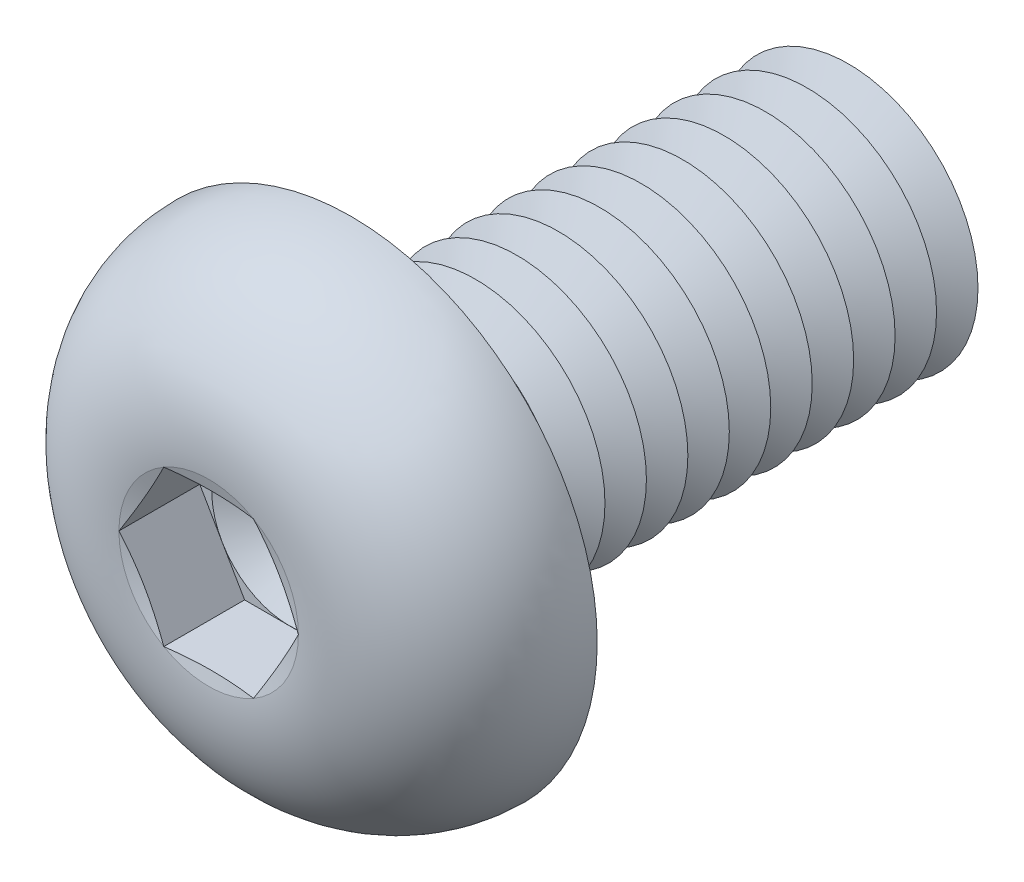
ISO-10303-21;
HEADER;
FILE_DESCRIPTION(('STEP AP214'),'2;1');
FILE_NAME('part.step','',(''),(''),'','','');
FILE_SCHEMA(('AUTOMOTIVE_DESIGN { 1 0 10303 214 1 1 1 1 }'));
ENDSEC;
DATA;
#1=APPLICATION_CONTEXT('core data for automotive mechanical design processes');
#2=APPLICATION_PROTOCOL_DEFINITION('international standard','automotive_design',2000,#1);
#3=PRODUCT_CONTEXT('',#1,'mechanical');
#4=PRODUCT('Part','Part','',(#3));
#5=PRODUCT_RELATED_PRODUCT_CATEGORY('part','',(#4));
#6=PRODUCT_DEFINITION_FORMATION('','',#4);
#7=PRODUCT_DEFINITION_CONTEXT('part definition',#1,'design');
#8=PRODUCT_DEFINITION('design','',#6,#7);
#9=PRODUCT_DEFINITION_SHAPE('','',#8);
#10=(LENGTH_UNIT() NAMED_UNIT(*) SI_UNIT(.MILLI.,.METRE.));
#11=(NAMED_UNIT(*) PLANE_ANGLE_UNIT() SI_UNIT($,.RADIAN.));
#12=(NAMED_UNIT(*) SI_UNIT($,.STERADIAN.) SOLID_ANGLE_UNIT());
#13=UNCERTAINTY_MEASURE_WITH_UNIT(LENGTH_MEASURE(1.E-05),#10,'distance_accuracy_value','');
#14=(GEOMETRIC_REPRESENTATION_CONTEXT(3) GLOBAL_UNCERTAINTY_ASSIGNED_CONTEXT((#13)) GLOBAL_UNIT_ASSIGNED_CONTEXT((#10,
#11,#12)) REPRESENTATION_CONTEXT('',''));
#15=CARTESIAN_POINT('',(0.,0.,0.));
#16=DIRECTION('',(0.,0.,1.));
#17=DIRECTION('',(1.,0.,0.));
#18=AXIS2_PLACEMENT_3D('',#15,#16,#17);
#19=CARTESIAN_POINT('',(0.,0.,1.19));
#20=DIRECTION('',(0.,0.,1.));
#21=DIRECTION('',(1.,0.,0.));
#22=AXIS2_PLACEMENT_3D('',#19,#20,#21);
#23=PLANE('',#22);
#24=CARTESIAN_POINT('',(0.,0.,1.19));
#25=DIRECTION('',(0.,0.,1.));
#26=DIRECTION('',(1.,0.,0.));
#27=AXIS2_PLACEMENT_3D('',#24,#25,#26);
#28=CIRCLE('',#27,1.49999930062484);
#29=CARTESIAN_POINT('',(1.2990375,0.749999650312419,1.19));
#30=VERTEX_POINT('',#29);
#31=CARTESIAN_POINT('',(0.,1.49999930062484,1.19));
#32=VERTEX_POINT('',#31);
#33=EDGE_CURVE('E118',#30,#32,#28,.T.);
#34=ORIENTED_EDGE('',*,*,#33,.F.);
#35=DIRECTION('',(-0.5,0.866025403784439,0.));
#36=VECTOR('',#35,1.);
#37=CARTESIAN_POINT('',(1.73205,0.,1.19));
#38=LINE('',#37,#36);
#39=CARTESIAN_POINT('',(0.866025,1.49999930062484,1.19));
#40=VERTEX_POINT('',#39);
#41=EDGE_CURVE('E125',#30,#40,#38,.T.);
#42=ORIENTED_EDGE('',*,*,#41,.T.);
#43=DIRECTION('',(-1.,0.,0.));
#44=VECTOR('',#43,1.);
#45=CARTESIAN_POINT('',(0.866025,1.49999930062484,1.19));
#46=LINE('',#45,#44);
#47=EDGE_CURVE('E136',#40,#32,#46,.T.);
#48=ORIENTED_EDGE('',*,*,#47,.T.);
#49=EDGE_LOOP('',(#34,#42,#48));
#50=FACE_BOUND('',#49,.T.);
#51=ADVANCED_FACE('F39',(#50),#23,.T.);
#52=CARTESIAN_POINT('',(0.,0.,1.19));
#53=DIRECTION('',(0.,0.,1.));
#54=DIRECTION('',(1.,0.,0.));
#55=AXIS2_PLACEMENT_3D('',#52,#53,#54);
#56=CIRCLE('',#55,1.49999930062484);
#57=CARTESIAN_POINT('',(-1.2990375,0.749999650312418,1.19));
#58=VERTEX_POINT('',#57);
#59=EDGE_CURVE('E11',#32,#58,#56,.T.);
#60=ORIENTED_EDGE('',*,*,#59,.F.);
#61=CARTESIAN_POINT('',(-0.866025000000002,1.49999930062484,1.19));
#62=VERTEX_POINT('',#61);
#63=EDGE_CURVE('E131',#32,#62,#46,.T.);
#64=ORIENTED_EDGE('',*,*,#63,.T.);
#65=DIRECTION('',(-0.5,-0.866025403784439,0.));
#66=VECTOR('',#65,1.);
#67=CARTESIAN_POINT('',(-0.866025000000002,1.49999930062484,1.19));
#68=LINE('',#67,#66);
#69=EDGE_CURVE('E134',#62,#58,#68,.T.);
#70=ORIENTED_EDGE('',*,*,#69,.T.);
#71=EDGE_LOOP('',(#60,#64,#70));
#72=FACE_BOUND('',#71,.T.);
#73=ADVANCED_FACE('F130',(#72),#23,.T.);
#74=CARTESIAN_POINT('',(-1.2990375,-0.749999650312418,1.19));
#75=VERTEX_POINT('',#74);
#76=EDGE_CURVE('E49',#58,#75,#56,.T.);
#77=ORIENTED_EDGE('',*,*,#76,.F.);
#78=CARTESIAN_POINT('',(-1.73205,0.,1.19));
#79=VERTEX_POINT('',#78);
#80=EDGE_CURVE('E143',#58,#79,#68,.T.);
#81=ORIENTED_EDGE('',*,*,#80,.T.);
#82=DIRECTION('',(0.5,-0.866025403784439,0.));
#83=VECTOR('',#82,1.);
#84=CARTESIAN_POINT('',(-1.73205,0.,1.19));
#85=LINE('',#84,#83);
#86=EDGE_CURVE('E151',#79,#75,#85,.T.);
#87=ORIENTED_EDGE('',*,*,#86,.T.);
#88=EDGE_LOOP('',(#77,#81,#87));
#89=FACE_BOUND('',#88,.T.);
#90=ADVANCED_FACE('F368',(#89),#23,.T.);
#91=CARTESIAN_POINT('',(0.,-1.49999930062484,1.19));
#92=VERTEX_POINT('',#91);
#93=EDGE_CURVE('E352',#75,#92,#56,.T.);
#94=ORIENTED_EDGE('',*,*,#93,.F.);
#95=CARTESIAN_POINT('',(-0.866025,-1.49999930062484,1.19));
#96=VERTEX_POINT('',#95);
#97=EDGE_CURVE('E150',#75,#96,#85,.T.);
#98=ORIENTED_EDGE('',*,*,#97,.T.);
#99=DIRECTION('',(1.,0.,0.));
#100=VECTOR('',#99,1.);
#101=CARTESIAN_POINT('',(-0.866025,-1.49999930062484,1.19));
#102=LINE('',#101,#100);
#103=EDGE_CURVE('E156',#96,#92,#102,.T.);
#104=ORIENTED_EDGE('',*,*,#103,.T.);
#105=EDGE_LOOP('',(#94,#98,#104));
#106=FACE_BOUND('',#105,.T.);
#107=ADVANCED_FACE('F361',(#106),#23,.T.);
#108=CARTESIAN_POINT('',(1.2990375,-0.749999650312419,1.19));
#109=VERTEX_POINT('',#108);
#110=EDGE_CURVE('E56',#92,#109,#56,.T.);
#111=ORIENTED_EDGE('',*,*,#110,.F.);
#112=CARTESIAN_POINT('',(0.866025,-1.49999930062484,1.19));
#113=VERTEX_POINT('',#112);
#114=EDGE_CURVE('E155',#92,#113,#102,.T.);
#115=ORIENTED_EDGE('',*,*,#114,.T.);
#116=DIRECTION('',(0.5,0.866025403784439,0.));
#117=VECTOR('',#116,1.);
#118=CARTESIAN_POINT('',(0.866025,-1.49999930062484,1.19));
#119=LINE('',#118,#117);
#120=EDGE_CURVE('E161',#113,#109,#119,.T.);
#121=ORIENTED_EDGE('',*,*,#120,.T.);
#122=EDGE_LOOP('',(#111,#115,#121));
#123=FACE_BOUND('',#122,.T.);
#124=ADVANCED_FACE('F428',(#123),#23,.T.);
#125=CARTESIAN_POINT('',(0.,0.,2.75));
#126=DIRECTION('',(0.,0.,1.));
#127=DIRECTION('',(1.,0.,0.));
#128=AXIS2_PLACEMENT_3D('',#125,#126,#127);
#129=CONICAL_SURFACE('',#128,1.73205,1.30899693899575);
#130=CARTESIAN_POINT('',(1.73216547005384,-0.000200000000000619,2.75003094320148));
#131=CARTESIAN_POINT('',(1.69619207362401,0.0621077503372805,2.74038633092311));
#132=CARTESIAN_POINT('',(1.66015343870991,0.124528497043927,2.73163050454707));
#133=CARTESIAN_POINT('',(1.58794885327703,0.249590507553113,2.71624720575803));
#134=CARTESIAN_POINT('',(1.5517828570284,0.312231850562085,2.70962059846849));
#135=CARTESIAN_POINT('',(1.47954289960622,0.437355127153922,2.69888271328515));
#136=CARTESIAN_POINT('',(1.4434694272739,0.499836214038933,2.69475862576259));
#137=CARTESIAN_POINT('',(1.37127646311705,0.624878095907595,2.68922863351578));
#138=CARTESIAN_POINT('',(1.33515698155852,0.687438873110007,2.68782220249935));
#139=CARTESIAN_POINT('',(1.26291801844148,0.812560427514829,2.68782220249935));
#140=CARTESIAN_POINT('',(1.22679853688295,0.875121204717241,2.68922863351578));
#141=CARTESIAN_POINT('',(1.1546055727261,1.0001630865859,2.69475862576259));
#142=CARTESIAN_POINT('',(1.11853210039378,1.06264417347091,2.69888271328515));
#143=CARTESIAN_POINT('',(1.0462921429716,1.18776745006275,2.70962059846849));
#144=CARTESIAN_POINT('',(1.01012614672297,1.25040879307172,2.71624720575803));
#145=CARTESIAN_POINT('',(0.937921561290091,1.37547080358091,2.73163050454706));
#146=CARTESIAN_POINT('',(0.901882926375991,1.43789155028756,2.74038633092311));
#147=CARTESIAN_POINT('',(0.865909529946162,1.50019930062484,2.75003094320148));
#148=B_SPLINE_CURVE_WITH_KNOTS('',3,(#130,#131,#132,#133,#134,#135,#136,#137,#138,#139,#140,
#141,#142,#143,#144,#145,#146,#147),.UNSPECIFIED.,.F.,.F.,(4,2,2,2,2,2,2,2,4),(0.,
0.217782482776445,0.435653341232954,0.652399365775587,0.869103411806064,1.08580745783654,
1.30255348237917,1.52042434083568,1.73820682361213),.UNSPECIFIED.);
#149=CARTESIAN_POINT('',(1.73205,0.,2.75));
#150=VERTEX_POINT('',#149);
#151=CARTESIAN_POINT('',(0.866025,1.49999930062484,2.75));
#152=VERTEX_POINT('',#151);
#153=EDGE_CURVE('E221',#150,#152,#148,.T.);
#154=ORIENTED_EDGE('',*,*,#153,.F.);
#155=CARTESIAN_POINT('',(0.,0.,2.75));
#156=DIRECTION('',(0.,0.,-1.));
#157=DIRECTION('',(-1.,0.,0.));
#158=AXIS2_PLACEMENT_3D('',#155,#156,#157);
#159=CIRCLE('',#158,1.73205);
#160=EDGE_CURVE('E399',#152,#150,#159,.T.);
#161=ORIENTED_EDGE('',*,*,#160,.F.);
#162=EDGE_LOOP('',(#154,#161));
#163=FACE_BOUND('',#162,.T.);
#164=ADVANCED_FACE('F419',(#163),#129,.F.);
#165=CARTESIAN_POINT('',(0.865909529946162,-1.50019930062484,2.75003094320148));
#166=CARTESIAN_POINT('',(0.901882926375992,-1.43789155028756,2.74038633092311));
#167=CARTESIAN_POINT('',(0.937921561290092,-1.37547080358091,2.73163050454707));
#168=CARTESIAN_POINT('',(1.01012614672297,-1.25040879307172,2.71624720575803));
#169=CARTESIAN_POINT('',(1.0462921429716,-1.18776745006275,2.70962059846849));
#170=CARTESIAN_POINT('',(1.11853210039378,-1.06264417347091,2.69888271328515));
#171=CARTESIAN_POINT('',(1.1546055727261,-1.0001630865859,2.69475862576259));
#172=CARTESIAN_POINT('',(1.22679853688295,-0.875121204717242,2.68922863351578));
#173=CARTESIAN_POINT('',(1.26291801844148,-0.81256042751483,2.68782220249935));
#174=CARTESIAN_POINT('',(1.33515698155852,-0.687438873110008,2.68782220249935));
#175=CARTESIAN_POINT('',(1.37127646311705,-0.624878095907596,2.68922863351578));
#176=CARTESIAN_POINT('',(1.4434694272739,-0.499836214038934,2.69475862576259));
#177=CARTESIAN_POINT('',(1.47954289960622,-0.437355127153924,2.69888271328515));
#178=CARTESIAN_POINT('',(1.55178285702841,-0.312231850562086,2.70962059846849));
#179=CARTESIAN_POINT('',(1.58794885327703,-0.249590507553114,2.71624720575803));
#180=CARTESIAN_POINT('',(1.66015343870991,-0.124528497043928,2.73163050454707));
#181=CARTESIAN_POINT('',(1.69619207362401,-0.0621077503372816,2.74038633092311));
#182=CARTESIAN_POINT('',(1.73216547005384,0.000199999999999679,2.75003094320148));
#183=B_SPLINE_CURVE_WITH_KNOTS('',3,(#165,#166,#167,#168,#169,#170,#171,#172,#173,#174,#175,
#176,#177,#178,#179,#180,#181,#182),.UNSPECIFIED.,.F.,.F.,(4,2,2,2,2,2,2,2,4),(0.,
0.217782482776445,0.435653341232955,0.652399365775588,0.869103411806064,1.08580745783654,
1.30255348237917,1.52042434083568,1.73820682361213),.UNSPECIFIED.);
#184=CARTESIAN_POINT('',(0.866025,-1.49999930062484,2.75));
#185=VERTEX_POINT('',#184);
#186=EDGE_CURVE('E230',#185,#150,#183,.T.);
#187=ORIENTED_EDGE('',*,*,#186,.F.);
#188=EDGE_CURVE('E401',#150,#185,#159,.T.);
#189=ORIENTED_EDGE('',*,*,#188,.F.);
#190=EDGE_LOOP('',(#187,#189));
#191=FACE_BOUND('',#190,.T.);
#192=ADVANCED_FACE('F420',(#191),#129,.F.);
#193=CARTESIAN_POINT('',(-2.61375031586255,-1.49999930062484,3.09338600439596));
#194=CARTESIAN_POINT('',(-2.48719895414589,-1.49999930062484,3.06401688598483));
#195=CARTESIAN_POINT('',(-2.36054180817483,-1.49999930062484,3.03507426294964));
#196=CARTESIAN_POINT('',(-2.10688190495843,-1.49999930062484,2.97862489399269));
#197=CARTESIAN_POINT('',(-1.97987908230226,-1.49999930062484,2.95111844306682));
#198=CARTESIAN_POINT('',(-1.72425281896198,-1.49999930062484,2.89788845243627));
#199=CARTESIAN_POINT('',(-1.59562534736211,-1.49999930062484,2.87218404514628));
#200=CARTESIAN_POINT('',(-1.33776732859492,-1.49999930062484,2.82387586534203));
#201=CARTESIAN_POINT('',(-1.20853672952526,-1.49999930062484,2.80127236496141));
#202=CARTESIAN_POINT('',(-0.952831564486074,-1.49999930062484,2.76126658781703));
#203=CARTESIAN_POINT('',(-0.826376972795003,-1.49999930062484,2.74374018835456));
#204=CARTESIAN_POINT('',(-0.5727557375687,-1.49999930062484,2.71502809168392));
#205=CARTESIAN_POINT('',(-0.445589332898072,-1.49999930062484,2.70384038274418));
#206=CARTESIAN_POINT('',(-0.191333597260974,-1.49999930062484,2.68972083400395));
#207=CARTESIAN_POINT('',(-0.0642464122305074,-1.49999930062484,2.68675270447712));
#208=CARTESIAN_POINT('',(0.189835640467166,-1.49999930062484,2.68959577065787));
#209=CARTESIAN_POINT('',(0.316830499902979,-1.49999930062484,2.69540767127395));
#210=CARTESIAN_POINT('',(0.534182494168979,-1.49999930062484,2.71190493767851));
#211=CARTESIAN_POINT('',(0.624691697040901,-1.49999930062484,2.72073513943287));
#212=CARTESIAN_POINT('',(0.80533656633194,-1.49999930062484,2.74156379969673));
#213=CARTESIAN_POINT('',(0.895472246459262,-1.49999930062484,2.75356214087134));
#214=CARTESIAN_POINT('',(1.0756572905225,-1.49999930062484,2.78006977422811));
#215=CARTESIAN_POINT('',(1.16570548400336,-1.49999930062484,2.7945868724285));
#216=CARTESIAN_POINT('',(1.3454787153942,-1.49999930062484,2.82550612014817));
#217=CARTESIAN_POINT('',(1.43520373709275,-1.49999930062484,2.8419083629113));
#218=CARTESIAN_POINT('',(1.61622412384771,-1.49999930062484,2.87648604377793));
#219=CARTESIAN_POINT('',(1.70751379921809,-1.49999930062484,2.89469103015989));
#220=CARTESIAN_POINT('',(1.88986344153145,-1.49999930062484,2.93221618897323));
#221=CARTESIAN_POINT('',(1.98092340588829,-1.49999930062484,2.95153637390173));
#222=CARTESIAN_POINT('',(2.16236354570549,-1.49999930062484,2.99091506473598));
#223=CARTESIAN_POINT('',(2.25274472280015,-1.49999930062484,3.01096897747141));
#224=CARTESIAN_POINT('',(2.43335289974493,-1.49999930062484,3.05173139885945));
#225=CARTESIAN_POINT('',(2.52357990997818,-1.49999930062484,3.07243986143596));
#226=CARTESIAN_POINT('',(2.61375031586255,-1.49999930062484,3.09338600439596));
#227=B_SPLINE_CURVE_WITH_KNOTS('',3,(#193,#194,#195,#196,#197,#198,#199,#200,#201,#202,#203,
#204,#205,#206,#207,#208,#209,#210,#211,#212,#213,#214,#215,#216,#217,#218,#219,#220,#221,#222,
#223,#224,#225,#226),.UNSPECIFIED.,.F.,.F.,(4,2,2,2,2,2,2,2,2,2,2,2,2,2,2,2,4),(0.,
0.389753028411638,0.779585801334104,1.17307326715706,1.5665952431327,1.94947555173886,
2.33223427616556,2.71330039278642,3.09439710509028,3.36715350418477,3.63989980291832,
3.91350699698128,4.18712773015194,4.4663802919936,4.74563598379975,5.02337106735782,
5.3010866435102),.UNSPECIFIED.);
#228=CARTESIAN_POINT('',(-0.866025,-1.49999930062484,2.75));
#229=VERTEX_POINT('',#228);
#230=EDGE_CURVE('E380',#229,#185,#227,.T.);
#231=ORIENTED_EDGE('',*,*,#230,.F.);
#232=EDGE_CURVE('E388',#185,#229,#159,.T.);
#233=ORIENTED_EDGE('',*,*,#232,.F.);
#234=EDGE_LOOP('',(#231,#233));
#235=FACE_BOUND('',#234,.T.);
#236=ADVANCED_FACE('F422',(#235),#129,.F.);
#237=CARTESIAN_POINT('',(-1.73216547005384,0.000200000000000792,2.75003094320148));
#238=CARTESIAN_POINT('',(-1.69619207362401,-0.0621077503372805,2.74038633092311));
#239=CARTESIAN_POINT('',(-1.66015343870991,-0.124528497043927,2.73163050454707));
#240=CARTESIAN_POINT('',(-1.58794885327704,-0.249590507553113,2.71624720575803));
#241=CARTESIAN_POINT('',(-1.55178285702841,-0.312231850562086,2.70962059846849));
#242=CARTESIAN_POINT('',(-1.47954289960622,-0.437355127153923,2.69888271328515));
#243=CARTESIAN_POINT('',(-1.4434694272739,-0.499836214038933,2.69475862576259));
#244=CARTESIAN_POINT('',(-1.37127646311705,-0.624878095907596,2.68922863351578));
#245=CARTESIAN_POINT('',(-1.33515698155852,-0.687438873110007,2.68782220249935));
#246=CARTESIAN_POINT('',(-1.26291801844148,-0.81256042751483,2.68782220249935));
#247=CARTESIAN_POINT('',(-1.22679853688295,-0.875121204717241,2.68922863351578));
#248=CARTESIAN_POINT('',(-1.1546055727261,-1.0001630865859,2.69475862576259));
#249=CARTESIAN_POINT('',(-1.11853210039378,-1.06264417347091,2.69888271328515));
#250=CARTESIAN_POINT('',(-1.0462921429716,-1.18776745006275,2.70962059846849));
#251=CARTESIAN_POINT('',(-1.01012614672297,-1.25040879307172,2.71624720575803));
#252=CARTESIAN_POINT('',(-0.937921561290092,-1.37547080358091,2.73163050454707));
#253=CARTESIAN_POINT('',(-0.901882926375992,-1.43789155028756,2.74038633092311));
#254=CARTESIAN_POINT('',(-0.865909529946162,-1.50019930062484,2.75003094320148));
#255=B_SPLINE_CURVE_WITH_KNOTS('',3,(#237,#238,#239,#240,#241,#242,#243,#244,#245,#246,#247,
#248,#249,#250,#251,#252,#253,#254),.UNSPECIFIED.,.F.,.F.,(4,2,2,2,2,2,2,2,4),(0.,
0.217782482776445,0.435653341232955,0.652399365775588,0.869103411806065,1.08580745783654,
1.30255348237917,1.52042434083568,1.73820682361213),.UNSPECIFIED.);
#256=CARTESIAN_POINT('',(-1.73205,0.,2.75));
#257=VERTEX_POINT('',#256);
#258=EDGE_CURVE('E373',#257,#229,#255,.T.);
#259=ORIENTED_EDGE('',*,*,#258,.F.);
#260=EDGE_CURVE('E332',#229,#257,#159,.T.);
#261=ORIENTED_EDGE('',*,*,#260,.F.);
#262=EDGE_LOOP('',(#259,#261));
#263=FACE_BOUND('',#262,.T.);
#264=ADVANCED_FACE('F377',(#263),#129,.F.);
#265=CARTESIAN_POINT('',(-0.865909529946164,1.50019930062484,2.75003094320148));
#266=CARTESIAN_POINT('',(-0.901882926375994,1.43789155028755,2.74038633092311));
#267=CARTESIAN_POINT('',(-0.937921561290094,1.37547080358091,2.73163050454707));
#268=CARTESIAN_POINT('',(-1.01012614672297,1.25040879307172,2.71624720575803));
#269=CARTESIAN_POINT('',(-1.0462921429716,1.18776745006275,2.70962059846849));
#270=CARTESIAN_POINT('',(-1.11853210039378,1.06264417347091,2.69888271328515));
#271=CARTESIAN_POINT('',(-1.1546055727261,1.0001630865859,2.69475862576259));
#272=CARTESIAN_POINT('',(-1.22679853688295,0.875121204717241,2.68922863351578));
#273=CARTESIAN_POINT('',(-1.26291801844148,0.81256042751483,2.68782220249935));
#274=CARTESIAN_POINT('',(-1.33515698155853,0.687438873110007,2.68782220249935));
#275=CARTESIAN_POINT('',(-1.37127646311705,0.624878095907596,2.68922863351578));
#276=CARTESIAN_POINT('',(-1.4434694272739,0.499836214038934,2.69475862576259));
#277=CARTESIAN_POINT('',(-1.47954289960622,0.437355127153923,2.69888271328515));
#278=CARTESIAN_POINT('',(-1.55178285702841,0.312231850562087,2.70962059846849));
#279=CARTESIAN_POINT('',(-1.58794885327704,0.249590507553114,2.71624720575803));
#280=CARTESIAN_POINT('',(-1.66015343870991,0.124528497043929,2.73163050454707));
#281=CARTESIAN_POINT('',(-1.69619207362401,0.0621077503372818,2.74038633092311));
#282=CARTESIAN_POINT('',(-1.73216547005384,-0.000199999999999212,2.75003094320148));
#283=B_SPLINE_CURVE_WITH_KNOTS('',3,(#265,#266,#267,#268,#269,#270,#271,#272,#273,#274,#275,
#276,#277,#278,#279,#280,#281,#282),.UNSPECIFIED.,.F.,.F.,(4,2,2,2,2,2,2,2,4),(0.,
0.217782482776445,0.435653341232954,0.652399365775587,0.869103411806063,1.08580745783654,
1.30255348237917,1.52042434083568,1.73820682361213),.UNSPECIFIED.);
#284=CARTESIAN_POINT('',(-0.866025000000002,1.49999930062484,2.75));
#285=VERTEX_POINT('',#284);
#286=EDGE_CURVE('E194',#285,#257,#283,.T.);
#287=ORIENTED_EDGE('',*,*,#286,.F.);
#288=EDGE_CURVE('E333',#257,#285,#159,.T.);
#289=ORIENTED_EDGE('',*,*,#288,.F.);
#290=EDGE_LOOP('',(#287,#289));
#291=FACE_BOUND('',#290,.T.);
#292=ADVANCED_FACE('F391',(#291),#129,.F.);
#293=CARTESIAN_POINT('',(0.,0.,-7.2));
#294=DIRECTION('',(0.,0.,1.));
#295=DIRECTION('',(1.,0.,0.));
#296=AXIS2_PLACEMENT_3D('',#293,#294,#295);
#297=CONICAL_SURFACE('',#296,2.5,1.0471975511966);
#298=CARTESIAN_POINT('',(0.,0.,-7.6));
#299=DIRECTION('',(0.,0.,1.));
#300=DIRECTION('',(1.,0.,0.));
#301=AXIS2_PLACEMENT_3D('',#298,#299,#300);
#302=CIRCLE('',#301,1.80717967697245);
#303=CARTESIAN_POINT('',(1.80717967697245,0.,-7.6));
#304=VERTEX_POINT('',#303);
#305=EDGE_CURVE('E304',#304,#304,#302,.T.);
#306=ORIENTED_EDGE('',*,*,#305,.T.);
#307=EDGE_LOOP('',(#306));
#308=FACE_BOUND('',#307,.T.);
#309=CARTESIAN_POINT('',(0.,0.,-7.2));
#310=DIRECTION('',(0.,0.,1.));
#311=DIRECTION('',(1.,0.,0.));
#312=AXIS2_PLACEMENT_3D('',#309,#310,#311);
#313=CIRCLE('',#312,2.5);
#314=CARTESIAN_POINT('',(2.5,0.,-7.2));
#315=VERTEX_POINT('',#314);
#316=EDGE_CURVE('E300',#315,#315,#313,.T.);
#317=ORIENTED_EDGE('',*,*,#316,.F.);
#318=EDGE_LOOP('',(#317));
#319=FACE_BOUND('',#318,.T.);
#320=ADVANCED_FACE('F650',(#308,#319),#297,.T.);
#321=CARTESIAN_POINT('',(0.,0.,-7.6));
#322=DIRECTION('',(0.,0.,-1.));
#323=DIRECTION('',(-1.,0.,0.));
#324=AXIS2_PLACEMENT_3D('',#321,#322,#323);
#325=CONICAL_SURFACE('',#324,1.80717967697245,1.0471975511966);
#326=CARTESIAN_POINT('',(0.,0.,-8.));
#327=DIRECTION('',(0.,0.,1.));
#328=DIRECTION('',(1.,0.,0.));
#329=AXIS2_PLACEMENT_3D('',#326,#327,#328);
#330=CIRCLE('',#329,2.5);
#331=CARTESIAN_POINT('',(2.5,0.,-8.));
#332=VERTEX_POINT('',#331);
#333=EDGE_CURVE('E308',#332,#332,#330,.T.);
#334=ORIENTED_EDGE('',*,*,#333,.T.);
#335=EDGE_LOOP('',(#334));
#336=FACE_BOUND('',#335,.T.);
#337=ORIENTED_EDGE('',*,*,#305,.F.);
#338=EDGE_LOOP('',(#337));
#339=FACE_BOUND('',#338,.T.);
#340=ADVANCED_FACE('F644',(#336,#339),#325,.T.);
#341=CARTESIAN_POINT('',(0.,2.50000000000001,-10.));
#342=DIRECTION('',(0.,0.,-1.));
#343=DIRECTION('',(-1.,0.,0.));
#344=AXIS2_PLACEMENT_3D('',#341,#342,#343);
#345=PLANE('',#344);
#346=CARTESIAN_POINT('',(0.,0.,-10.));
#347=DIRECTION('',(0.,0.,1.));
#348=DIRECTION('',(1.,0.,0.));
#349=AXIS2_PLACEMENT_3D('',#346,#347,#348);
#350=CIRCLE('',#349,1.80717967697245);
#351=CARTESIAN_POINT('',(1.80717967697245,0.,-10.));
#352=VERTEX_POINT('',#351);
#353=EDGE_CURVE('E328',#352,#352,#350,.T.);
#354=ORIENTED_EDGE('',*,*,#353,.F.);
#355=EDGE_LOOP('',(#354));
#356=FACE_BOUND('',#355,.T.);
#357=ADVANCED_FACE('F637',(#356),#345,.T.);
#358=CARTESIAN_POINT('',(0.,0.,-9.6));
#359=DIRECTION('',(0.,0.,1.));
#360=DIRECTION('',(1.,0.,0.));
#361=AXIS2_PLACEMENT_3D('',#358,#359,#360);
#362=CONICAL_SURFACE('',#361,2.5,1.0471975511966);
#363=ORIENTED_EDGE('',*,*,#353,.T.);
#364=EDGE_LOOP('',(#363));
#365=FACE_BOUND('',#364,.T.);
#366=CARTESIAN_POINT('',(0.,0.,-9.6));
#367=DIRECTION('',(0.,0.,1.));
#368=DIRECTION('',(1.,0.,0.));
#369=AXIS2_PLACEMENT_3D('',#366,#367,#368);
#370=CIRCLE('',#369,2.5);
#371=CARTESIAN_POINT('',(2.5,0.,-9.6));
#372=VERTEX_POINT('',#371);
#373=EDGE_CURVE('E324',#372,#372,#370,.T.);
#374=ORIENTED_EDGE('',*,*,#373,.F.);
#375=EDGE_LOOP('',(#374));
#376=FACE_BOUND('',#375,.T.);
#377=ADVANCED_FACE('F630',(#365,#376),#362,.T.);
#378=CARTESIAN_POINT('',(0.,0.,-9.2));
#379=DIRECTION('',(0.,0.,-1.));
#380=DIRECTION('',(-1.,0.,0.));
#381=AXIS2_PLACEMENT_3D('',#378,#379,#380);
#382=CONICAL_SURFACE('',#381,1.80717967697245,1.0471975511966);
#383=ORIENTED_EDGE('',*,*,#373,.T.);
#384=EDGE_LOOP('',(#383));
#385=FACE_BOUND('',#384,.T.);
#386=CARTESIAN_POINT('',(0.,0.,-9.2));
#387=DIRECTION('',(0.,0.,1.));
#388=DIRECTION('',(1.,0.,0.));
#389=AXIS2_PLACEMENT_3D('',#386,#387,#388);
#390=CIRCLE('',#389,1.80717967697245);
#391=CARTESIAN_POINT('',(1.80717967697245,0.,-9.2));
#392=VERTEX_POINT('',#391);
#393=EDGE_CURVE('E320',#392,#392,#390,.T.);
#394=ORIENTED_EDGE('',*,*,#393,.F.);
#395=EDGE_LOOP('',(#394));
#396=FACE_BOUND('',#395,.T.);
#397=ADVANCED_FACE('F623',(#385,#396),#382,.T.);
#398=CARTESIAN_POINT('',(0.,0.,-8.8));
#399=DIRECTION('',(0.,0.,1.));
#400=DIRECTION('',(1.,0.,0.));
#401=AXIS2_PLACEMENT_3D('',#398,#399,#400);
#402=CONICAL_SURFACE('',#401,2.5,1.0471975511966);
#403=ORIENTED_EDGE('',*,*,#393,.T.);
#404=EDGE_LOOP('',(#403));
#405=FACE_BOUND('',#404,.T.);
#406=CARTESIAN_POINT('',(0.,0.,-8.8));
#407=DIRECTION('',(0.,0.,1.));
#408=DIRECTION('',(1.,0.,0.));
#409=AXIS2_PLACEMENT_3D('',#406,#407,#408);
#410=CIRCLE('',#409,2.5);
#411=CARTESIAN_POINT('',(2.5,0.,-8.8));
#412=VERTEX_POINT('',#411);
#413=EDGE_CURVE('E316',#412,#412,#410,.T.);
#414=ORIENTED_EDGE('',*,*,#413,.F.);
#415=EDGE_LOOP('',(#414));
#416=FACE_BOUND('',#415,.T.);
#417=ADVANCED_FACE('F616',(#405,#416),#402,.T.);
#418=CARTESIAN_POINT('',(0.,0.,-8.4));
#419=DIRECTION('',(0.,0.,-1.));
#420=DIRECTION('',(-1.,0.,0.));
#421=AXIS2_PLACEMENT_3D('',#418,#419,#420);
#422=CONICAL_SURFACE('',#421,1.80717967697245,1.0471975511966);
#423=ORIENTED_EDGE('',*,*,#413,.T.);
#424=EDGE_LOOP('',(#423));
#425=FACE_BOUND('',#424,.T.);
#426=CARTESIAN_POINT('',(0.,0.,-8.4));
#427=DIRECTION('',(0.,0.,1.));
#428=DIRECTION('',(1.,0.,0.));
#429=AXIS2_PLACEMENT_3D('',#426,#427,#428);
#430=CIRCLE('',#429,1.80717967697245);
#431=CARTESIAN_POINT('',(1.80717967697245,0.,-8.4));
#432=VERTEX_POINT('',#431);
#433=EDGE_CURVE('E312',#432,#432,#430,.T.);
#434=ORIENTED_EDGE('',*,*,#433,.F.);
#435=EDGE_LOOP('',(#434));
#436=FACE_BOUND('',#435,.T.);
#437=ADVANCED_FACE('F609',(#425,#436),#422,.T.);
#438=CARTESIAN_POINT('',(0.,0.,-8.));
#439=DIRECTION('',(0.,0.,1.));
#440=DIRECTION('',(1.,0.,0.));
#441=AXIS2_PLACEMENT_3D('',#438,#439,#440);
#442=CONICAL_SURFACE('',#441,2.5,1.0471975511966);
#443=ORIENTED_EDGE('',*,*,#433,.T.);
#444=EDGE_LOOP('',(#443));
#445=FACE_BOUND('',#444,.T.);
#446=ORIENTED_EDGE('',*,*,#333,.F.);
#447=EDGE_LOOP('',(#446));
#448=FACE_BOUND('',#447,.T.);
#449=ADVANCED_FACE('F602',(#445,#448),#442,.T.);
#450=CARTESIAN_POINT('',(0.,0.,-6.4));
#451=DIRECTION('',(0.,0.,1.));
#452=DIRECTION('',(1.,0.,0.));
#453=AXIS2_PLACEMENT_3D('',#450,#451,#452);
#454=CONICAL_SURFACE('',#453,2.5,1.0471975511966);
#455=CARTESIAN_POINT('',(0.,0.,-6.8));
#456=DIRECTION('',(0.,0.,1.));
#457=DIRECTION('',(1.,0.,0.));
#458=AXIS2_PLACEMENT_3D('',#455,#456,#457);
#459=CIRCLE('',#458,1.80717967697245);
#460=CARTESIAN_POINT('',(1.80717967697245,0.,-6.8));
#461=VERTEX_POINT('',#460);
#462=EDGE_CURVE('E296',#461,#461,#459,.T.);
#463=ORIENTED_EDGE('',*,*,#462,.T.);
#464=EDGE_LOOP('',(#463));
#465=FACE_BOUND('',#464,.T.);
#466=CARTESIAN_POINT('',(0.,0.,-6.4));
#467=DIRECTION('',(0.,0.,1.));
#468=DIRECTION('',(1.,0.,0.));
#469=AXIS2_PLACEMENT_3D('',#466,#467,#468);
#470=CIRCLE('',#469,2.5);
#471=CARTESIAN_POINT('',(2.5,0.,-6.4));
#472=VERTEX_POINT('',#471);
#473=EDGE_CURVE('E292',#472,#472,#470,.T.);
#474=ORIENTED_EDGE('',*,*,#473,.F.);
#475=EDGE_LOOP('',(#474));
#476=FACE_BOUND('',#475,.T.);
#477=ADVANCED_FACE('F595',(#465,#476),#454,.T.);
#478=CARTESIAN_POINT('',(0.,0.,-6.8));
#479=DIRECTION('',(0.,0.,-1.));
#480=DIRECTION('',(-1.,0.,0.));
#481=AXIS2_PLACEMENT_3D('',#478,#479,#480);
#482=CONICAL_SURFACE('',#481,1.80717967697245,1.0471975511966);
#483=ORIENTED_EDGE('',*,*,#316,.T.);
#484=EDGE_LOOP('',(#483));
#485=FACE_BOUND('',#484,.T.);
#486=ORIENTED_EDGE('',*,*,#462,.F.);
#487=EDGE_LOOP('',(#486));
#488=FACE_BOUND('',#487,.T.);
#489=ADVANCED_FACE('F588',(#485,#488),#482,.T.);
#490=CARTESIAN_POINT('',(0.,0.,-5.6));
#491=DIRECTION('',(0.,0.,1.));
#492=DIRECTION('',(1.,0.,0.));
#493=AXIS2_PLACEMENT_3D('',#490,#491,#492);
#494=CONICAL_SURFACE('',#493,2.5,1.0471975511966);
#495=CARTESIAN_POINT('',(0.,0.,-6.));
#496=DIRECTION('',(0.,0.,1.));
#497=DIRECTION('',(1.,0.,0.));
#498=AXIS2_PLACEMENT_3D('',#495,#496,#497);
#499=CIRCLE('',#498,1.80717967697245);
#500=CARTESIAN_POINT('',(1.80717967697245,0.,-6.));
#501=VERTEX_POINT('',#500);
#502=EDGE_CURVE('E288',#501,#501,#499,.T.);
#503=ORIENTED_EDGE('',*,*,#502,.T.);
#504=EDGE_LOOP('',(#503));
#505=FACE_BOUND('',#504,.T.);
#506=CARTESIAN_POINT('',(0.,0.,-5.6));
#507=DIRECTION('',(0.,0.,1.));
#508=DIRECTION('',(1.,0.,0.));
#509=AXIS2_PLACEMENT_3D('',#506,#507,#508);
#510=CIRCLE('',#509,2.5);
#511=CARTESIAN_POINT('',(2.5,0.,-5.6));
#512=VERTEX_POINT('',#511);
#513=EDGE_CURVE('E284',#512,#512,#510,.T.);
#514=ORIENTED_EDGE('',*,*,#513,.F.);
#515=EDGE_LOOP('',(#514));
#516=FACE_BOUND('',#515,.T.);
#517=ADVANCED_FACE('F581',(#505,#516),#494,.T.);
#518=CARTESIAN_POINT('',(0.,0.,-6.));
#519=DIRECTION('',(0.,0.,-1.));
#520=DIRECTION('',(-1.,0.,0.));
#521=AXIS2_PLACEMENT_3D('',#518,#519,#520);
#522=CONICAL_SURFACE('',#521,1.80717967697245,1.0471975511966);
#523=ORIENTED_EDGE('',*,*,#473,.T.);
#524=EDGE_LOOP('',(#523));
#525=FACE_BOUND('',#524,.T.);
#526=ORIENTED_EDGE('',*,*,#502,.F.);
#527=EDGE_LOOP('',(#526));
#528=FACE_BOUND('',#527,.T.);
#529=ADVANCED_FACE('F574',(#525,#528),#522,.T.);
#530=CARTESIAN_POINT('',(0.,0.,-4.8));
#531=DIRECTION('',(0.,0.,1.));
#532=DIRECTION('',(1.,0.,0.));
#533=AXIS2_PLACEMENT_3D('',#530,#531,#532);
#534=CONICAL_SURFACE('',#533,2.5,1.0471975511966);
#535=CARTESIAN_POINT('',(0.,0.,-5.2));
#536=DIRECTION('',(0.,0.,1.));
#537=DIRECTION('',(1.,0.,0.));
#538=AXIS2_PLACEMENT_3D('',#535,#536,#537);
#539=CIRCLE('',#538,1.80717967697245);
#540=CARTESIAN_POINT('',(1.80717967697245,0.,-5.2));
#541=VERTEX_POINT('',#540);
#542=EDGE_CURVE('E280',#541,#541,#539,.T.);
#543=ORIENTED_EDGE('',*,*,#542,.T.);
#544=EDGE_LOOP('',(#543));
#545=FACE_BOUND('',#544,.T.);
#546=CARTESIAN_POINT('',(0.,0.,-4.8));
#547=DIRECTION('',(0.,0.,1.));
#548=DIRECTION('',(1.,0.,0.));
#549=AXIS2_PLACEMENT_3D('',#546,#547,#548);
#550=CIRCLE('',#549,2.5);
#551=CARTESIAN_POINT('',(2.5,0.,-4.8));
#552=VERTEX_POINT('',#551);
#553=EDGE_CURVE('E276',#552,#552,#550,.T.);
#554=ORIENTED_EDGE('',*,*,#553,.F.);
#555=EDGE_LOOP('',(#554));
#556=FACE_BOUND('',#555,.T.);
#557=ADVANCED_FACE('F567',(#545,#556),#534,.T.);
#558=CARTESIAN_POINT('',(0.,0.,-5.2));
#559=DIRECTION('',(0.,0.,-1.));
#560=DIRECTION('',(-1.,0.,0.));
#561=AXIS2_PLACEMENT_3D('',#558,#559,#560);
#562=CONICAL_SURFACE('',#561,1.80717967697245,1.0471975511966);
#563=ORIENTED_EDGE('',*,*,#513,.T.);
#564=EDGE_LOOP('',(#563));
#565=FACE_BOUND('',#564,.T.);
#566=ORIENTED_EDGE('',*,*,#542,.F.);
#567=EDGE_LOOP('',(#566));
#568=FACE_BOUND('',#567,.T.);
#569=ADVANCED_FACE('F560',(#565,#568),#562,.T.);
#570=CARTESIAN_POINT('',(0.,0.,-4.));
#571=DIRECTION('',(0.,0.,1.));
#572=DIRECTION('',(1.,0.,0.));
#573=AXIS2_PLACEMENT_3D('',#570,#571,#572);
#574=CONICAL_SURFACE('',#573,2.5,1.0471975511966);
#575=CARTESIAN_POINT('',(0.,0.,-4.4));
#576=DIRECTION('',(0.,0.,1.));
#577=DIRECTION('',(1.,0.,0.));
#578=AXIS2_PLACEMENT_3D('',#575,#576,#577);
#579=CIRCLE('',#578,1.80717967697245);
#580=CARTESIAN_POINT('',(1.80717967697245,0.,-4.4));
#581=VERTEX_POINT('',#580);
#582=EDGE_CURVE('E272',#581,#581,#579,.T.);
#583=ORIENTED_EDGE('',*,*,#582,.T.);
#584=EDGE_LOOP('',(#583));
#585=FACE_BOUND('',#584,.T.);
#586=CARTESIAN_POINT('',(0.,0.,-4.));
#587=DIRECTION('',(0.,0.,1.));
#588=DIRECTION('',(1.,0.,0.));
#589=AXIS2_PLACEMENT_3D('',#586,#587,#588);
#590=CIRCLE('',#589,2.5);
#591=CARTESIAN_POINT('',(2.5,0.,-4.));
#592=VERTEX_POINT('',#591);
#593=EDGE_CURVE('E268',#592,#592,#590,.T.);
#594=ORIENTED_EDGE('',*,*,#593,.F.);
#595=EDGE_LOOP('',(#594));
#596=FACE_BOUND('',#595,.T.);
#597=ADVANCED_FACE('F553',(#585,#596),#574,.T.);
#598=CARTESIAN_POINT('',(0.,0.,-4.4));
#599=DIRECTION('',(0.,0.,-1.));
#600=DIRECTION('',(-1.,0.,0.));
#601=AXIS2_PLACEMENT_3D('',#598,#599,#600);
#602=CONICAL_SURFACE('',#601,1.80717967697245,1.0471975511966);
#603=ORIENTED_EDGE('',*,*,#553,.T.);
#604=EDGE_LOOP('',(#603));
#605=FACE_BOUND('',#604,.T.);
#606=ORIENTED_EDGE('',*,*,#582,.F.);
#607=EDGE_LOOP('',(#606));
#608=FACE_BOUND('',#607,.T.);
#609=ADVANCED_FACE('F546',(#605,#608),#602,.T.);
#610=CARTESIAN_POINT('',(0.,0.,-3.2));
#611=DIRECTION('',(0.,0.,1.));
#612=DIRECTION('',(1.,0.,0.));
#613=AXIS2_PLACEMENT_3D('',#610,#611,#612);
#614=CONICAL_SURFACE('',#613,2.5,1.0471975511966);
#615=CARTESIAN_POINT('',(0.,0.,-3.6));
#616=DIRECTION('',(0.,0.,1.));
#617=DIRECTION('',(1.,0.,0.));
#618=AXIS2_PLACEMENT_3D('',#615,#616,#617);
#619=CIRCLE('',#618,1.80717967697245);
#620=CARTESIAN_POINT('',(1.80717967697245,0.,-3.6));
#621=VERTEX_POINT('',#620);
#622=EDGE_CURVE('E264',#621,#621,#619,.T.);
#623=ORIENTED_EDGE('',*,*,#622,.T.);
#624=EDGE_LOOP('',(#623));
#625=FACE_BOUND('',#624,.T.);
#626=CARTESIAN_POINT('',(0.,0.,-3.2));
#627=DIRECTION('',(0.,0.,1.));
#628=DIRECTION('',(1.,0.,0.));
#629=AXIS2_PLACEMENT_3D('',#626,#627,#628);
#630=CIRCLE('',#629,2.5);
#631=CARTESIAN_POINT('',(2.5,0.,-3.2));
#632=VERTEX_POINT('',#631);
#633=EDGE_CURVE('E260',#632,#632,#630,.T.);
#634=ORIENTED_EDGE('',*,*,#633,.F.);
#635=EDGE_LOOP('',(#634));
#636=FACE_BOUND('',#635,.T.);
#637=ADVANCED_FACE('F539',(#625,#636),#614,.T.);
#638=CARTESIAN_POINT('',(0.,0.,-3.6));
#639=DIRECTION('',(0.,0.,-1.));
#640=DIRECTION('',(-1.,0.,0.));
#641=AXIS2_PLACEMENT_3D('',#638,#639,#640);
#642=CONICAL_SURFACE('',#641,1.80717967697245,1.0471975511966);
#643=ORIENTED_EDGE('',*,*,#593,.T.);
#644=EDGE_LOOP('',(#643));
#645=FACE_BOUND('',#644,.T.);
#646=ORIENTED_EDGE('',*,*,#622,.F.);
#647=EDGE_LOOP('',(#646));
#648=FACE_BOUND('',#647,.T.);
#649=ADVANCED_FACE('F532',(#645,#648),#642,.T.);
#650=CARTESIAN_POINT('',(0.,0.,-2.4));
#651=DIRECTION('',(0.,0.,1.));
#652=DIRECTION('',(1.,0.,0.));
#653=AXIS2_PLACEMENT_3D('',#650,#651,#652);
#654=CONICAL_SURFACE('',#653,2.5,1.0471975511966);
#655=CARTESIAN_POINT('',(0.,0.,-2.8));
#656=DIRECTION('',(0.,0.,1.));
#657=DIRECTION('',(1.,0.,0.));
#658=AXIS2_PLACEMENT_3D('',#655,#656,#657);
#659=CIRCLE('',#658,1.80717967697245);
#660=CARTESIAN_POINT('',(1.80717967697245,0.,-2.8));
#661=VERTEX_POINT('',#660);
#662=EDGE_CURVE('E256',#661,#661,#659,.T.);
#663=ORIENTED_EDGE('',*,*,#662,.T.);
#664=EDGE_LOOP('',(#663));
#665=FACE_BOUND('',#664,.T.);
#666=CARTESIAN_POINT('',(0.,0.,-2.4));
#667=DIRECTION('',(0.,0.,1.));
#668=DIRECTION('',(1.,0.,0.));
#669=AXIS2_PLACEMENT_3D('',#666,#667,#668);
#670=CIRCLE('',#669,2.5);
#671=CARTESIAN_POINT('',(2.5,0.,-2.4));
#672=VERTEX_POINT('',#671);
#673=EDGE_CURVE('E252',#672,#672,#670,.T.);
#674=ORIENTED_EDGE('',*,*,#673,.F.);
#675=EDGE_LOOP('',(#674));
#676=FACE_BOUND('',#675,.T.);
#677=ADVANCED_FACE('F525',(#665,#676),#654,.T.);
#678=CARTESIAN_POINT('',(0.,0.,-2.8));
#679=DIRECTION('',(0.,0.,-1.));
#680=DIRECTION('',(-1.,0.,0.));
#681=AXIS2_PLACEMENT_3D('',#678,#679,#680);
#682=CONICAL_SURFACE('',#681,1.80717967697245,1.0471975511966);
#683=ORIENTED_EDGE('',*,*,#633,.T.);
#684=EDGE_LOOP('',(#683));
#685=FACE_BOUND('',#684,.T.);
#686=ORIENTED_EDGE('',*,*,#662,.F.);
#687=EDGE_LOOP('',(#686));
#688=FACE_BOUND('',#687,.T.);
#689=ADVANCED_FACE('F518',(#685,#688),#682,.T.);
#690=CARTESIAN_POINT('',(0.,0.,-1.6));
#691=DIRECTION('',(0.,0.,1.));
#692=DIRECTION('',(1.,0.,0.));
#693=AXIS2_PLACEMENT_3D('',#690,#691,#692);
#694=CONICAL_SURFACE('',#693,2.5,1.0471975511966);
#695=CARTESIAN_POINT('',(0.,0.,-2.));
#696=DIRECTION('',(0.,0.,1.));
#697=DIRECTION('',(1.,0.,0.));
#698=AXIS2_PLACEMENT_3D('',#695,#696,#697);
#699=CIRCLE('',#698,1.80717967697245);
#700=CARTESIAN_POINT('',(1.80717967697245,0.,-2.));
#701=VERTEX_POINT('',#700);
#702=EDGE_CURVE('E248',#701,#701,#699,.T.);
#703=ORIENTED_EDGE('',*,*,#702,.T.);
#704=EDGE_LOOP('',(#703));
#705=FACE_BOUND('',#704,.T.);
#706=CARTESIAN_POINT('',(0.,0.,-1.6));
#707=DIRECTION('',(0.,0.,1.));
#708=DIRECTION('',(1.,0.,0.));
#709=AXIS2_PLACEMENT_3D('',#706,#707,#708);
#710=CIRCLE('',#709,2.5);
#711=CARTESIAN_POINT('',(2.5,0.,-1.6));
#712=VERTEX_POINT('',#711);
#713=EDGE_CURVE('E240',#712,#712,#710,.T.);
#714=ORIENTED_EDGE('',*,*,#713,.F.);
#715=EDGE_LOOP('',(#714));
#716=FACE_BOUND('',#715,.T.);
#717=ADVANCED_FACE('F511',(#705,#716),#694,.T.);
#718=CARTESIAN_POINT('',(0.,0.,-2.));
#719=DIRECTION('',(0.,0.,-1.));
#720=DIRECTION('',(-1.,0.,0.));
#721=AXIS2_PLACEMENT_3D('',#718,#719,#720);
#722=CONICAL_SURFACE('',#721,1.80717967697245,1.0471975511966);
#723=ORIENTED_EDGE('',*,*,#673,.T.);
#724=EDGE_LOOP('',(#723));
#725=FACE_BOUND('',#724,.T.);
#726=ORIENTED_EDGE('',*,*,#702,.F.);
#727=EDGE_LOOP('',(#726));
#728=FACE_BOUND('',#727,.T.);
#729=ADVANCED_FACE('F505',(#725,#728),#722,.T.);
#730=CARTESIAN_POINT('',(0.,0.,-0.799999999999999));
#731=DIRECTION('',(0.,0.,1.));
#732=DIRECTION('',(1.,0.,0.));
#733=AXIS2_PLACEMENT_3D('',#730,#731,#732);
#734=CONICAL_SURFACE('',#733,2.5,1.0471975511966);
#735=CARTESIAN_POINT('',(0.,0.,-1.2));
#736=DIRECTION('',(0.,0.,1.));
#737=DIRECTION('',(1.,0.,0.));
#738=AXIS2_PLACEMENT_3D('',#735,#736,#737);
#739=CIRCLE('',#738,1.80717967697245);
#740=CARTESIAN_POINT('',(1.80717967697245,0.,-1.2));
#741=VERTEX_POINT('',#740);
#742=EDGE_CURVE('E229',#741,#741,#739,.T.);
#743=ORIENTED_EDGE('',*,*,#742,.T.);
#744=EDGE_LOOP('',(#743));
#745=FACE_BOUND('',#744,.T.);
#746=CARTESIAN_POINT('',(0.,0.,-0.799999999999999));
#747=DIRECTION('',(0.,0.,1.));
#748=DIRECTION('',(1.,0.,0.));
#749=AXIS2_PLACEMENT_3D('',#746,#747,#748);
#750=CIRCLE('',#749,2.5);
#751=CARTESIAN_POINT('',(2.5,0.,-0.799999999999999));
#752=VERTEX_POINT('',#751);
#753=EDGE_CURVE('E244',#752,#752,#750,.T.);
#754=ORIENTED_EDGE('',*,*,#753,.F.);
#755=EDGE_LOOP('',(#754));
#756=FACE_BOUND('',#755,.T.);
#757=ADVANCED_FACE('F499',(#745,#756),#734,.T.);
#758=CARTESIAN_POINT('',(0.,0.,-1.2));
#759=DIRECTION('',(0.,0.,-1.));
#760=DIRECTION('',(-1.,0.,0.));
#761=AXIS2_PLACEMENT_3D('',#758,#759,#760);
#762=CONICAL_SURFACE('',#761,1.80717967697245,1.0471975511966);
#763=ORIENTED_EDGE('',*,*,#713,.T.);
#764=EDGE_LOOP('',(#763));
#765=FACE_BOUND('',#764,.T.);
#766=ORIENTED_EDGE('',*,*,#742,.F.);
#767=EDGE_LOOP('',(#766));
#768=FACE_BOUND('',#767,.T.);
#769=ADVANCED_FACE('F218',(#765,#768),#762,.T.);
#770=CARTESIAN_POINT('',(2.61375031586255,1.49999930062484,3.09338600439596));
#771=CARTESIAN_POINT('',(2.48719895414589,1.49999930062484,3.06401688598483));
#772=CARTESIAN_POINT('',(2.36054180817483,1.49999930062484,3.03507426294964));
#773=CARTESIAN_POINT('',(2.10688190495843,1.49999930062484,2.97862489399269));
#774=CARTESIAN_POINT('',(1.97987908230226,1.49999930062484,2.95111844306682));
#775=CARTESIAN_POINT('',(1.72425281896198,1.49999930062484,2.89788845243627));
#776=CARTESIAN_POINT('',(1.59562534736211,1.49999930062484,2.87218404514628));
#777=CARTESIAN_POINT('',(1.33776732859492,1.49999930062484,2.82387586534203));
#778=CARTESIAN_POINT('',(1.20853672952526,1.49999930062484,2.80127236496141));
#779=CARTESIAN_POINT('',(0.952831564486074,1.49999930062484,2.76126658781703));
#780=CARTESIAN_POINT('',(0.826376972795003,1.49999930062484,2.74374018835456));
#781=CARTESIAN_POINT('',(0.5727557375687,1.49999930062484,2.71502809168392));
#782=CARTESIAN_POINT('',(0.445589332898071,1.49999930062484,2.70384038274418));
#783=CARTESIAN_POINT('',(0.191333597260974,1.49999930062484,2.68972083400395));
#784=CARTESIAN_POINT('',(0.0642464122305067,1.49999930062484,2.68675270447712));
#785=CARTESIAN_POINT('',(-0.189835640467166,1.49999930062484,2.68959577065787));
#786=CARTESIAN_POINT('',(-0.31683049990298,1.49999930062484,2.69540767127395));
#787=CARTESIAN_POINT('',(-0.53418249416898,1.49999930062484,2.71190493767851));
#788=CARTESIAN_POINT('',(-0.624691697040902,1.49999930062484,2.72073513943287));
#789=CARTESIAN_POINT('',(-0.805336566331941,1.49999930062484,2.74156379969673));
#790=CARTESIAN_POINT('',(-0.895472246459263,1.49999930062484,2.75356214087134));
#791=CARTESIAN_POINT('',(-1.0756572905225,1.49999930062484,2.78006977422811));
#792=CARTESIAN_POINT('',(-1.16570548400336,1.49999930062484,2.7945868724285));
#793=CARTESIAN_POINT('',(-1.3454787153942,1.49999930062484,2.82550612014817));
#794=CARTESIAN_POINT('',(-1.43520373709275,1.49999930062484,2.8419083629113));
#795=CARTESIAN_POINT('',(-1.61622412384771,1.49999930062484,2.87648604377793));
#796=CARTESIAN_POINT('',(-1.7075137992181,1.49999930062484,2.89469103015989));
#797=CARTESIAN_POINT('',(-1.88986344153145,1.49999930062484,2.93221618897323));
#798=CARTESIAN_POINT('',(-1.98092340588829,1.49999930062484,2.95153637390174));
#799=CARTESIAN_POINT('',(-2.16236354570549,1.49999930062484,2.99091506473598));
#800=CARTESIAN_POINT('',(-2.25274472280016,1.49999930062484,3.01096897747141));
#801=CARTESIAN_POINT('',(-2.43335289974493,1.49999930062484,3.05173139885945));
#802=CARTESIAN_POINT('',(-2.52357990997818,1.49999930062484,3.07243986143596));
#803=CARTESIAN_POINT('',(-2.61375031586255,1.49999930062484,3.09338600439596));
#804=B_SPLINE_CURVE_WITH_KNOTS('',3,(#770,#771,#772,#773,#774,#775,#776,#777,#778,#779,#780,
#781,#782,#783,#784,#785,#786,#787,#788,#789,#790,#791,#792,#793,#794,#795,#796,#797,#798,#799,
#800,#801,#802,#803),.UNSPECIFIED.,.F.,.F.,(4,2,2,2,2,2,2,2,2,2,2,2,2,2,2,2,4),(0.,
0.389753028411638,0.779585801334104,1.17307326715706,1.5665952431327,1.94947555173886,
2.33223427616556,2.71330039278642,3.09439710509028,3.36715350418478,3.63989980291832,
3.91350699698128,4.18712773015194,4.46638029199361,4.74563598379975,5.02337106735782,
5.3010866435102),.UNSPECIFIED.);
#805=EDGE_CURVE('E169',#152,#285,#804,.T.);
#806=ORIENTED_EDGE('',*,*,#805,.F.);
#807=EDGE_CURVE('E337',#285,#152,#159,.T.);
#808=ORIENTED_EDGE('',*,*,#807,.F.);
#809=EDGE_LOOP('',(#806,#808));
#810=FACE_BOUND('',#809,.T.);
#811=ADVANCED_FACE('F201',(#810),#129,.F.);
#812=CARTESIAN_POINT('',(0.,0.,0.));
#813=DIRECTION('',(0.,0.,-1.));
#814=DIRECTION('',(-1.,0.,0.));
#815=AXIS2_PLACEMENT_3D('',#812,#813,#814);
#816=DEGENERATE_TOROIDAL_SURFACE('',#815,1.98810497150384,2.76189502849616,.T.);
#817=ORIENTED_EDGE('',*,*,#288,.T.);
#818=ORIENTED_EDGE('',*,*,#807,.T.);
#819=ORIENTED_EDGE('',*,*,#160,.T.);
#820=ORIENTED_EDGE('',*,*,#188,.T.);
#821=ORIENTED_EDGE('',*,*,#232,.T.);
#822=ORIENTED_EDGE('',*,*,#260,.T.);
#823=EDGE_LOOP('',(#817,#818,#819,#820,#821,#822));
#824=FACE_BOUND('',#823,.T.);
#825=CARTESIAN_POINT('',(0.,0.,0.));
#826=DIRECTION('',(0.,0.,-1.));
#827=DIRECTION('',(-1.,0.,0.));
#828=AXIS2_PLACEMENT_3D('',#825,#826,#827);
#829=CIRCLE('',#828,4.75);
#830=CARTESIAN_POINT('',(-4.75,0.,0.));
#831=VERTEX_POINT('',#830);
#832=EDGE_CURVE('E336',#831,#831,#829,.T.);
#833=ORIENTED_EDGE('',*,*,#832,.F.);
#834=EDGE_LOOP('',(#833));
#835=FACE_BOUND('',#834,.T.);
#836=ADVANCED_FACE('F383',(#824,#835),#816,.T.);
#837=CARTESIAN_POINT('',(0.,2.5,0.));
#838=DIRECTION('',(0.,0.,-1.));
#839=DIRECTION('',(-1.,0.,0.));
#840=AXIS2_PLACEMENT_3D('',#837,#838,#839);
#841=PLANE('',#840);
#842=CARTESIAN_POINT('',(0.,0.,0.));
#843=DIRECTION('',(0.,0.,-1.));
#844=DIRECTION('',(-1.,0.,0.));
#845=AXIS2_PLACEMENT_3D('',#842,#843,#844);
#846=CIRCLE('',#845,2.9);
#847=CARTESIAN_POINT('',(-2.9,0.,0.));
#848=VERTEX_POINT('',#847);
#849=EDGE_CURVE('E344',#848,#848,#846,.F.);
#850=ORIENTED_EDGE('',*,*,#849,.T.);
#851=EDGE_LOOP('',(#850));
#852=FACE_BOUND('',#851,.T.);
#853=ORIENTED_EDGE('',*,*,#832,.T.);
#854=EDGE_LOOP('',(#853));
#855=FACE_BOUND('',#854,.T.);
#856=ADVANCED_FACE('F480',(#852,#855),#841,.T.);
#857=CARTESIAN_POINT('',(0.,0.,-0.399999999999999));
#858=DIRECTION('',(0.,0.,-1.));
#859=DIRECTION('',(-1.,0.,0.));
#860=AXIS2_PLACEMENT_3D('',#857,#858,#859);
#861=TOROIDAL_SURFACE('',#860,2.9,0.4);
#862=ORIENTED_EDGE('',*,*,#849,.F.);
#863=EDGE_LOOP('',(#862));
#864=FACE_BOUND('',#863,.T.);
#865=CARTESIAN_POINT('',(0.,0.,-0.399999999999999));
#866=DIRECTION('',(0.,0.,-1.));
#867=DIRECTION('',(-1.,0.,0.));
#868=AXIS2_PLACEMENT_3D('',#865,#866,#867);
#869=CIRCLE('',#868,2.5);
#870=CARTESIAN_POINT('',(-2.5,0.,-0.399999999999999));
#871=VERTEX_POINT('',#870);
#872=EDGE_CURVE('E341',#871,#871,#869,.T.);
#873=ORIENTED_EDGE('',*,*,#872,.F.);
#874=EDGE_LOOP('',(#873));
#875=FACE_BOUND('',#874,.T.);
#876=ADVANCED_FACE('F41',(#864,#875),#861,.F.);
#877=CARTESIAN_POINT('',(0.,0.,-10.));
#878=DIRECTION('',(0.,0.,-1.));
#879=DIRECTION('',(-1.,0.,0.));
#880=AXIS2_PLACEMENT_3D('',#877,#878,#879);
#881=CYLINDRICAL_SURFACE('',#880,2.5);
#882=ORIENTED_EDGE('',*,*,#872,.T.);
#883=EDGE_LOOP('',(#882));
#884=FACE_BOUND('',#883,.T.);
#885=ORIENTED_EDGE('',*,*,#753,.T.);
#886=EDGE_LOOP('',(#885));
#887=FACE_BOUND('',#886,.T.);
#888=ADVANCED_FACE('F216',(#884,#887),#881,.T.);
#889=CARTESIAN_POINT('',(1.73205,0.,1.19));
#890=DIRECTION('',(0.866025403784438,0.5,0.));
#891=DIRECTION('',(-0.5,0.866025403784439,0.));
#892=AXIS2_PLACEMENT_3D('',#889,#890,#891);
#893=PLANE('',#892);
#894=ORIENTED_EDGE('',*,*,#153,.T.);
#895=DIRECTION('',(0.,0.,1.));
#896=VECTOR('',#895,1.);
#897=CARTESIAN_POINT('',(0.866025,1.49999930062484,1.19));
#898=LINE('',#897,#896);
#899=EDGE_CURVE('E64',#40,#152,#898,.T.);
#900=ORIENTED_EDGE('',*,*,#899,.F.);
#901=ORIENTED_EDGE('',*,*,#41,.F.);
#902=CARTESIAN_POINT('',(1.73205,0.,1.19));
#903=VERTEX_POINT('',#902);
#904=EDGE_CURVE('E140',#903,#30,#38,.T.);
#905=ORIENTED_EDGE('',*,*,#904,.F.);
#906=DIRECTION('',(0.,0.,1.));
#907=VECTOR('',#906,1.);
#908=CARTESIAN_POINT('',(1.73205,0.,1.19));
#909=LINE('',#908,#907);
#910=EDGE_CURVE('E165',#903,#150,#909,.T.);
#911=ORIENTED_EDGE('',*,*,#910,.T.);
#912=EDGE_LOOP('',(#894,#900,#901,#905,#911));
#913=FACE_BOUND('',#912,.T.);
#914=ADVANCED_FACE('F211',(#913),#893,.F.);
#915=CARTESIAN_POINT('',(0.866025,-1.49999930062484,1.19));
#916=DIRECTION('',(0.866025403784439,-0.5,0.));
#917=DIRECTION('',(0.5,0.866025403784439,0.));
#918=AXIS2_PLACEMENT_3D('',#915,#916,#917);
#919=PLANE('',#918);
#920=ORIENTED_EDGE('',*,*,#186,.T.);
#921=ORIENTED_EDGE('',*,*,#910,.F.);
#922=EDGE_CURVE('E160',#109,#903,#119,.T.);
#923=ORIENTED_EDGE('',*,*,#922,.F.);
#924=ORIENTED_EDGE('',*,*,#120,.F.);
#925=DIRECTION('',(0.,0.,1.));
#926=VECTOR('',#925,1.);
#927=CARTESIAN_POINT('',(0.866025,-1.49999930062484,1.19));
#928=LINE('',#927,#926);
#929=EDGE_CURVE('E170',#113,#185,#928,.T.);
#930=ORIENTED_EDGE('',*,*,#929,.T.);
#931=EDGE_LOOP('',(#920,#921,#923,#924,#930));
#932=FACE_BOUND('',#931,.T.);
#933=ADVANCED_FACE('F215',(#932),#919,.F.);
#934=CARTESIAN_POINT('',(-0.866025,-1.49999930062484,1.19));
#935=DIRECTION('',(0.,-1.,0.));
#936=DIRECTION('',(0.,0.,-1.));
#937=AXIS2_PLACEMENT_3D('',#934,#935,#936);
#938=PLANE('',#937);
#939=ORIENTED_EDGE('',*,*,#230,.T.);
#940=ORIENTED_EDGE('',*,*,#929,.F.);
#941=ORIENTED_EDGE('',*,*,#114,.F.);
#942=ORIENTED_EDGE('',*,*,#103,.F.);
#943=DIRECTION('',(0.,0.,1.));
#944=VECTOR('',#943,1.);
#945=CARTESIAN_POINT('',(-0.866025,-1.49999930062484,1.19));
#946=LINE('',#945,#944);
#947=EDGE_CURVE('E174',#96,#229,#946,.T.);
#948=ORIENTED_EDGE('',*,*,#947,.T.);
#949=EDGE_LOOP('',(#939,#940,#941,#942,#948));
#950=FACE_BOUND('',#949,.T.);
#951=ADVANCED_FACE('F445',(#950),#938,.F.);
#952=CARTESIAN_POINT('',(-1.73205,0.,1.19));
#953=DIRECTION('',(-0.866025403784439,-0.5,0.));
#954=DIRECTION('',(0.5,-0.866025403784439,0.));
#955=AXIS2_PLACEMENT_3D('',#952,#953,#954);
#956=PLANE('',#955);
#957=ORIENTED_EDGE('',*,*,#258,.T.);
#958=ORIENTED_EDGE('',*,*,#947,.F.);
#959=ORIENTED_EDGE('',*,*,#97,.F.);
#960=ORIENTED_EDGE('',*,*,#86,.F.);
#961=DIRECTION('',(0.,0.,1.));
#962=VECTOR('',#961,1.);
#963=CARTESIAN_POINT('',(-1.73205,0.,1.19));
#964=LINE('',#963,#962);
#965=EDGE_CURVE('E178',#79,#257,#964,.T.);
#966=ORIENTED_EDGE('',*,*,#965,.T.);
#967=EDGE_LOOP('',(#957,#958,#959,#960,#966));
#968=FACE_BOUND('',#967,.T.);
#969=ADVANCED_FACE('F366',(#968),#956,.F.);
#970=CARTESIAN_POINT('',(-0.866025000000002,1.49999930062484,1.19));
#971=DIRECTION('',(-0.866025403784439,0.5,0.));
#972=DIRECTION('',(-0.5,-0.866025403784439,0.));
#973=AXIS2_PLACEMENT_3D('',#970,#971,#972);
#974=PLANE('',#973);
#975=ORIENTED_EDGE('',*,*,#286,.T.);
#976=ORIENTED_EDGE('',*,*,#965,.F.);
#977=ORIENTED_EDGE('',*,*,#80,.F.);
#978=ORIENTED_EDGE('',*,*,#69,.F.);
#979=DIRECTION('',(0.,0.,1.));
#980=VECTOR('',#979,1.);
#981=CARTESIAN_POINT('',(-0.866025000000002,1.49999930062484,1.19));
#982=LINE('',#981,#980);
#983=EDGE_CURVE('E138',#62,#285,#982,.T.);
#984=ORIENTED_EDGE('',*,*,#983,.T.);
#985=EDGE_LOOP('',(#975,#976,#977,#978,#984));
#986=FACE_BOUND('',#985,.T.);
#987=ADVANCED_FACE('F208',(#986),#974,.F.);
#988=CARTESIAN_POINT('',(0.866025,1.49999930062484,1.19));
#989=DIRECTION('',(0.,1.,0.));
#990=DIRECTION('',(0.,0.,1.));
#991=AXIS2_PLACEMENT_3D('',#988,#989,#990);
#992=PLANE('',#991);
#993=ORIENTED_EDGE('',*,*,#805,.T.);
#994=ORIENTED_EDGE('',*,*,#983,.F.);
#995=ORIENTED_EDGE('',*,*,#63,.F.);
#996=ORIENTED_EDGE('',*,*,#47,.F.);
#997=ORIENTED_EDGE('',*,*,#899,.T.);
#998=EDGE_LOOP('',(#993,#994,#995,#996,#997));
#999=FACE_BOUND('',#998,.T.);
#1000=ADVANCED_FACE('F135',(#999),#992,.F.);
#1001=EDGE_CURVE('E43',#109,#30,#56,.T.);
#1002=ORIENTED_EDGE('',*,*,#1001,.F.);
#1003=ORIENTED_EDGE('',*,*,#922,.T.);
#1004=ORIENTED_EDGE('',*,*,#904,.T.);
#1005=EDGE_LOOP('',(#1002,#1003,#1004));
#1006=FACE_BOUND('',#1005,.T.);
#1007=ADVANCED_FACE('F115',(#1006),#23,.T.);
#1008=CARTESIAN_POINT('',(0.,0.,1.19));
#1009=DIRECTION('',(0.,0.,1.));
#1010=DIRECTION('',(1.,0.,0.));
#1011=AXIS2_PLACEMENT_3D('',#1008,#1009,#1010);
#1012=CONICAL_SURFACE('',#1011,1.49999930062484,1.0471975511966);
#1013=CARTESIAN_POINT('',(0.,0.,0.323975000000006));
#1014=VERTEX_POINT('',#1013);
#1015=VERTEX_LOOP('',#1014);
#1016=FACE_BOUND('',#1015,.T.);
#1017=ORIENTED_EDGE('',*,*,#33,.T.);
#1018=ORIENTED_EDGE('',*,*,#59,.T.);
#1019=ORIENTED_EDGE('',*,*,#76,.T.);
#1020=ORIENTED_EDGE('',*,*,#93,.T.);
#1021=ORIENTED_EDGE('',*,*,#110,.T.);
#1022=ORIENTED_EDGE('',*,*,#1001,.T.);
#1023=EDGE_LOOP('',(#1017,#1018,#1019,#1020,#1021,#1022));
#1024=FACE_BOUND('',#1023,.T.);
#1025=ADVANCED_FACE('F113',(#1016,#1024),#1012,.F.);
#1026=CLOSED_SHELL('',(#51,#73,#90,#107,#124,#164,#192,#236,#264,#292,#320,#340,#357,#377,#397,
#417,#437,#449,#477,#489,#517,#529,#557,#569,#597,#609,#637,#649,#677,#689,#717,#729,#757,#769,
#811,#836,#856,#876,#888,#914,#933,#951,#969,#987,#1000,#1007,#1025));
#1027=MANIFOLD_SOLID_BREP('B2',#1026);
#1028=ADVANCED_BREP_SHAPE_REPRESENTATION('',(#18,#1027),#14);
#1029=SHAPE_DEFINITION_REPRESENTATION(#9,#1028);
ENDSEC;
END-ISO-10303-21;
